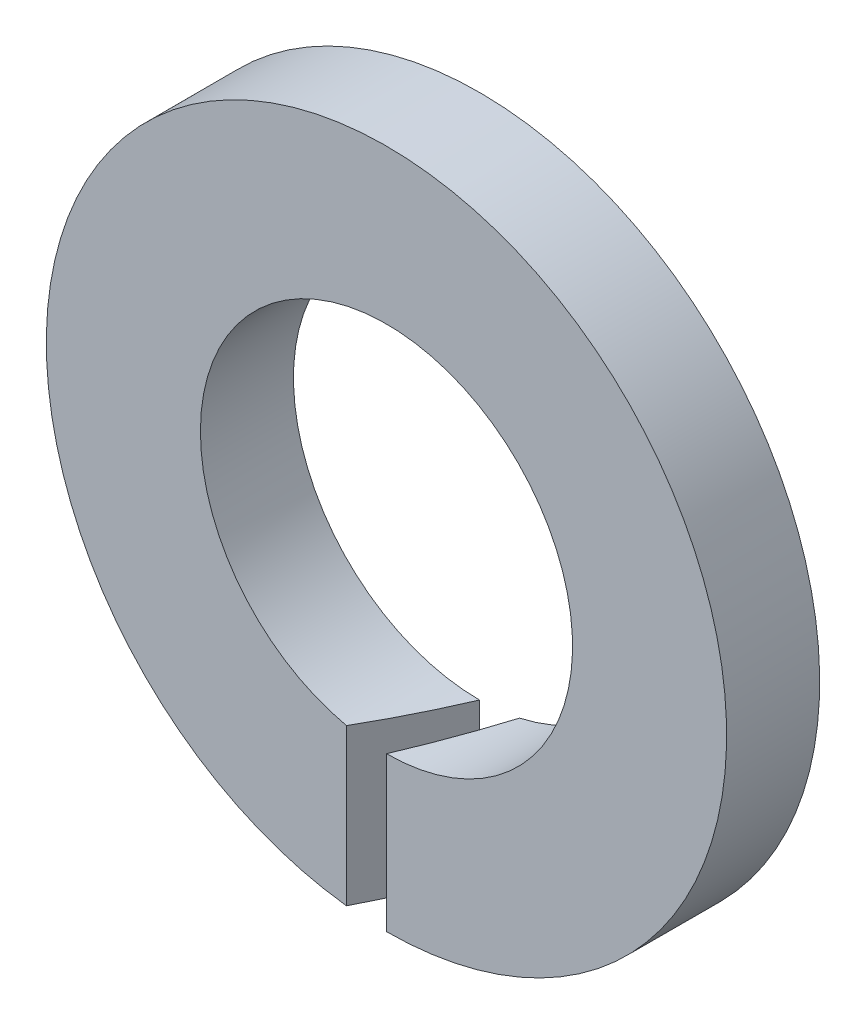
ISO-10303-21;
HEADER;
FILE_DESCRIPTION(('STEP AP214'),'2;1');
FILE_NAME('part.step','',(''),(''),'','','');
FILE_SCHEMA(('AUTOMOTIVE_DESIGN { 1 0 10303 214 1 1 1 1 }'));
ENDSEC;
DATA;
#1=APPLICATION_CONTEXT('core data for automotive mechanical design processes');
#2=APPLICATION_PROTOCOL_DEFINITION('international standard','automotive_design',2000,#1);
#3=PRODUCT_CONTEXT('',#1,'mechanical');
#4=PRODUCT('Part','Part','',(#3));
#5=PRODUCT_RELATED_PRODUCT_CATEGORY('part','',(#4));
#6=PRODUCT_DEFINITION_FORMATION('','',#4);
#7=PRODUCT_DEFINITION_CONTEXT('part definition',#1,'design');
#8=PRODUCT_DEFINITION('design','',#6,#7);
#9=PRODUCT_DEFINITION_SHAPE('','',#8);
#10=(LENGTH_UNIT() NAMED_UNIT(*) SI_UNIT(.MILLI.,.METRE.));
#11=(NAMED_UNIT(*) PLANE_ANGLE_UNIT() SI_UNIT($,.RADIAN.));
#12=(NAMED_UNIT(*) SI_UNIT($,.STERADIAN.) SOLID_ANGLE_UNIT());
#13=UNCERTAINTY_MEASURE_WITH_UNIT(LENGTH_MEASURE(1.E-05),#10,'distance_accuracy_value','');
#14=(GEOMETRIC_REPRESENTATION_CONTEXT(3) GLOBAL_UNCERTAINTY_ASSIGNED_CONTEXT((#13)) GLOBAL_UNIT_ASSIGNED_CONTEXT((#10,
#11,#12)) REPRESENTATION_CONTEXT('',''));
#15=CARTESIAN_POINT('',(0.,0.,0.));
#16=DIRECTION('',(0.,0.,1.));
#17=DIRECTION('',(1.,0.,0.));
#18=AXIS2_PLACEMENT_3D('',#15,#16,#17);
#19=CARTESIAN_POINT('',(0.,0.,0.));
#20=DIRECTION('',(0.,0.,-1.));
#21=DIRECTION('',(0.,1.,0.));
#22=AXIS2_PLACEMENT_3D('',#19,#20,#21);
#23=CYLINDRICAL_SURFACE('',#22,3.2);
#24=CARTESIAN_POINT('',(0.,0.,1.6));
#25=DIRECTION('',(0.,0.,-1.));
#26=DIRECTION('',(0.,1.,0.));
#27=AXIS2_PLACEMENT_3D('',#24,#25,#26);
#28=CIRCLE('',#27,3.2);
#29=CARTESIAN_POINT('',(-0.688235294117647,-3.12511314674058,1.6));
#30=VERTEX_POINT('',#29);
#31=CARTESIAN_POINT('',(0.,-3.2,1.6));
#32=VERTEX_POINT('',#31);
#33=EDGE_CURVE('E10',#30,#32,#28,.T.);
#34=ORIENTED_EDGE('',*,*,#33,.F.);
#35=CARTESIAN_POINT('',(0.,0.,0.));
#36=DIRECTION('',(-0.91862015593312,0.,-0.395141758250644));
#37=DIRECTION('',(0.395141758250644,0.,-0.91862015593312));
#38=AXIS2_PLACEMENT_3D('',#35,#36,#37);
#39=ELLIPSE('',#38,8.09835947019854,3.2);
#40=CARTESIAN_POINT('',(0.,-3.2,0.));
#41=VERTEX_POINT('',#40);
#42=EDGE_CURVE('E78',#30,#41,#39,.F.);
#43=ORIENTED_EDGE('',*,*,#42,.T.);
#44=CARTESIAN_POINT('',(0.,0.,0.));
#45=DIRECTION('',(0.,0.,-1.));
#46=DIRECTION('',(0.,1.,0.));
#47=AXIS2_PLACEMENT_3D('',#44,#45,#46);
#48=CIRCLE('',#47,3.2);
#49=CARTESIAN_POINT('',(0.688235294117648,-3.12511314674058,0.));
#50=VERTEX_POINT('',#49);
#51=EDGE_CURVE('E73',#41,#50,#48,.T.);
#52=ORIENTED_EDGE('',*,*,#51,.T.);
#53=CARTESIAN_POINT('',(0.,0.,1.6));
#54=DIRECTION('',(-0.91862015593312,0.,-0.395141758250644));
#55=DIRECTION('',(0.395141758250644,0.,-0.91862015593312));
#56=AXIS2_PLACEMENT_3D('',#53,#54,#55);
#57=ELLIPSE('',#56,8.09835947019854,3.2);
#58=EDGE_CURVE('E30',#32,#50,#57,.F.);
#59=ORIENTED_EDGE('',*,*,#58,.F.);
#60=EDGE_LOOP('',(#34,#43,#52,#59));
#61=FACE_BOUND('',#60,.T.);
#62=ADVANCED_FACE('F16',(#61),#23,.F.);
#63=CARTESIAN_POINT('',(5.85,0.,1.6));
#64=DIRECTION('',(0.,0.,1.));
#65=DIRECTION('',(0.,-1.,0.));
#66=AXIS2_PLACEMENT_3D('',#63,#64,#65);
#67=PLANE('',#66);
#68=DIRECTION('',(0.,1.,0.));
#69=VECTOR('',#68,1.);
#70=CARTESIAN_POINT('',(-0.688235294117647,-6.115,1.6));
#71=LINE('',#70,#69);
#72=CARTESIAN_POINT('',(-0.688235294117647,-5.80937450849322,1.6));
#73=VERTEX_POINT('',#72);
#74=EDGE_CURVE('E63',#73,#30,#71,.T.);
#75=ORIENTED_EDGE('',*,*,#74,.T.);
#76=ORIENTED_EDGE('',*,*,#33,.T.);
#77=DIRECTION('',(0.,1.,0.));
#78=VECTOR('',#77,1.);
#79=CARTESIAN_POINT('',(0.,-6.115,1.6));
#80=LINE('',#79,#78);
#81=CARTESIAN_POINT('',(0.,-5.85,1.6));
#82=VERTEX_POINT('',#81);
#83=EDGE_CURVE('E57',#82,#32,#80,.T.);
#84=ORIENTED_EDGE('',*,*,#83,.F.);
#85=CARTESIAN_POINT('',(0.,0.,1.6));
#86=DIRECTION('',(0.,0.,-1.));
#87=DIRECTION('',(0.,1.,0.));
#88=AXIS2_PLACEMENT_3D('',#85,#86,#87);
#89=CIRCLE('',#88,5.85);
#90=EDGE_CURVE('E23',#73,#82,#89,.T.);
#91=ORIENTED_EDGE('',*,*,#90,.F.);
#92=EDGE_LOOP('',(#75,#76,#84,#91));
#93=FACE_BOUND('',#92,.T.);
#94=ADVANCED_FACE('F68',(#93),#67,.T.);
#95=CARTESIAN_POINT('',(0.,0.,0.));
#96=DIRECTION('',(0.,0.,-1.));
#97=DIRECTION('',(0.,1.,0.));
#98=AXIS2_PLACEMENT_3D('',#95,#96,#97);
#99=CYLINDRICAL_SURFACE('',#98,5.85);
#100=CARTESIAN_POINT('',(0.,0.,0.));
#101=DIRECTION('',(-0.91862015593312,0.,-0.395141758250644));
#102=DIRECTION('',(0.395141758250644,0.,-0.91862015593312));
#103=AXIS2_PLACEMENT_3D('',#100,#101,#102);
#104=ELLIPSE('',#103,14.8048134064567,5.85);
#105=CARTESIAN_POINT('',(0.,-5.85,0.));
#106=VERTEX_POINT('',#105);
#107=EDGE_CURVE('E38',#73,#106,#104,.F.);
#108=ORIENTED_EDGE('',*,*,#107,.F.);
#109=ORIENTED_EDGE('',*,*,#90,.T.);
#110=CARTESIAN_POINT('',(0.,0.,1.6));
#111=DIRECTION('',(-0.91862015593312,0.,-0.395141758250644));
#112=DIRECTION('',(0.395141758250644,0.,-0.91862015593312));
#113=AXIS2_PLACEMENT_3D('',#110,#111,#112);
#114=ELLIPSE('',#113,14.8048134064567,5.85);
#115=CARTESIAN_POINT('',(0.688235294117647,-5.80937450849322,0.));
#116=VERTEX_POINT('',#115);
#117=EDGE_CURVE('E54',#82,#116,#114,.F.);
#118=ORIENTED_EDGE('',*,*,#117,.T.);
#119=CARTESIAN_POINT('',(0.,0.,0.));
#120=DIRECTION('',(0.,0.,-1.));
#121=DIRECTION('',(0.,1.,0.));
#122=AXIS2_PLACEMENT_3D('',#119,#120,#121);
#123=CIRCLE('',#122,5.85);
#124=EDGE_CURVE('E72',#106,#116,#123,.T.);
#125=ORIENTED_EDGE('',*,*,#124,.F.);
#126=EDGE_LOOP('',(#108,#109,#118,#125));
#127=FACE_BOUND('',#126,.T.);
#128=ADVANCED_FACE('F71',(#127),#99,.T.);
#129=CARTESIAN_POINT('',(3.2,0.,0.));
#130=DIRECTION('',(0.,0.,-1.));
#131=DIRECTION('',(0.,1.,0.));
#132=AXIS2_PLACEMENT_3D('',#129,#130,#131);
#133=PLANE('',#132);
#134=DIRECTION('',(0.,1.,0.));
#135=VECTOR('',#134,1.);
#136=CARTESIAN_POINT('',(0.,-6.115,0.));
#137=LINE('',#136,#135);
#138=EDGE_CURVE('E83',#106,#41,#137,.T.);
#139=ORIENTED_EDGE('',*,*,#138,.F.);
#140=ORIENTED_EDGE('',*,*,#124,.T.);
#141=DIRECTION('',(0.,1.,0.));
#142=VECTOR('',#141,1.);
#143=CARTESIAN_POINT('',(0.688235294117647,-6.115,0.));
#144=LINE('',#143,#142);
#145=EDGE_CURVE('E58',#116,#50,#144,.T.);
#146=ORIENTED_EDGE('',*,*,#145,.T.);
#147=ORIENTED_EDGE('',*,*,#51,.F.);
#148=EDGE_LOOP('',(#139,#140,#146,#147));
#149=FACE_BOUND('',#148,.T.);
#150=ADVANCED_FACE('F89',(#149),#133,.T.);
#151=CARTESIAN_POINT('',(0.688235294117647,-6.115,0.));
#152=DIRECTION('',(-0.91862015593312,0.,-0.395141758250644));
#153=DIRECTION('',(0.395141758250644,0.,-0.91862015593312));
#154=AXIS2_PLACEMENT_3D('',#151,#152,#153);
#155=PLANE('',#154);
#156=ORIENTED_EDGE('',*,*,#58,.T.);
#157=ORIENTED_EDGE('',*,*,#145,.F.);
#158=ORIENTED_EDGE('',*,*,#117,.F.);
#159=ORIENTED_EDGE('',*,*,#83,.T.);
#160=EDGE_LOOP('',(#156,#157,#158,#159));
#161=FACE_BOUND('',#160,.T.);
#162=ADVANCED_FACE('F56',(#161),#155,.T.);
#163=CARTESIAN_POINT('',(0.,-6.115,0.));
#164=DIRECTION('',(-0.91862015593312,0.,-0.395141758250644));
#165=DIRECTION('',(0.395141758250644,0.,-0.91862015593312));
#166=AXIS2_PLACEMENT_3D('',#163,#164,#165);
#167=PLANE('',#166);
#168=ORIENTED_EDGE('',*,*,#74,.F.);
#169=ORIENTED_EDGE('',*,*,#107,.T.);
#170=ORIENTED_EDGE('',*,*,#138,.T.);
#171=ORIENTED_EDGE('',*,*,#42,.F.);
#172=EDGE_LOOP('',(#168,#169,#170,#171));
#173=FACE_BOUND('',#172,.T.);
#174=ADVANCED_FACE('F90',(#173),#167,.F.);
#175=CLOSED_SHELL('',(#62,#94,#128,#150,#162,#174));
#176=MANIFOLD_SOLID_BREP('B1',#175);
#177=ADVANCED_BREP_SHAPE_REPRESENTATION('',(#18,#176),#14);
#178=SHAPE_DEFINITION_REPRESENTATION(#9,#177);
ENDSEC;
END-ISO-10303-21;
